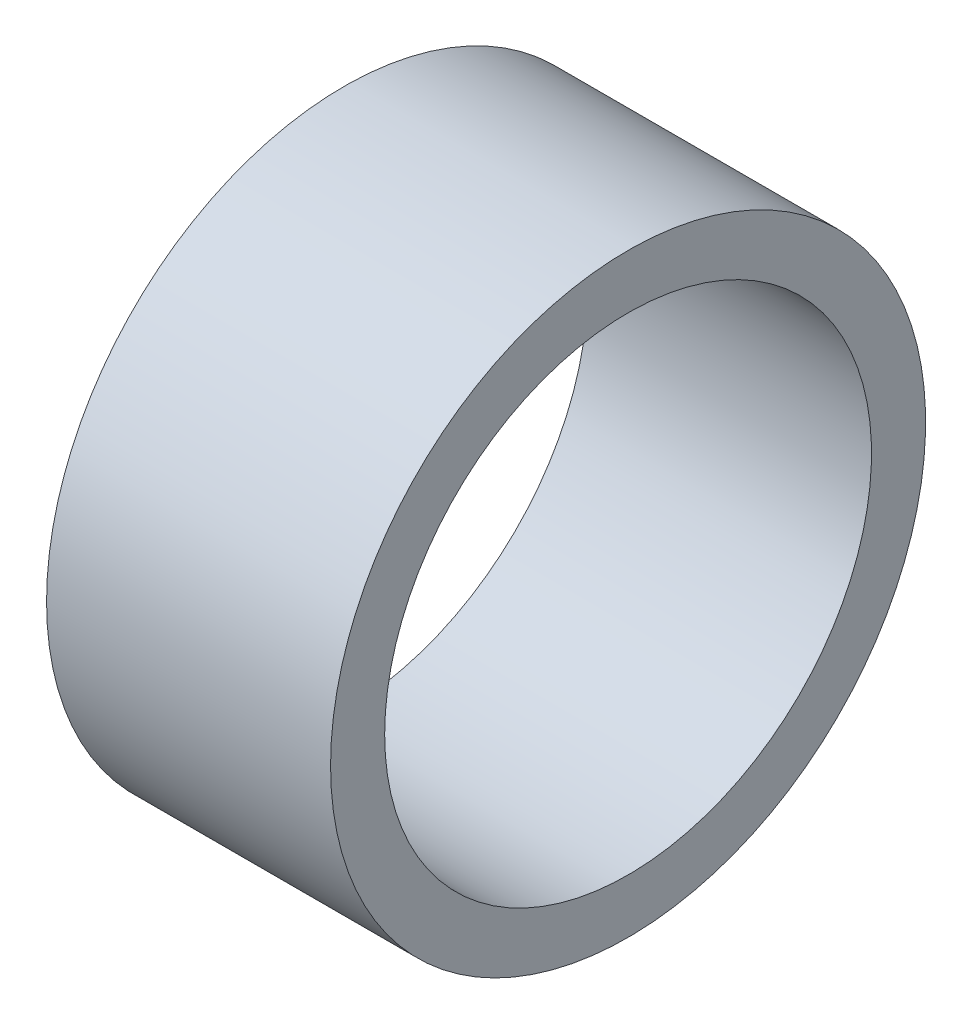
from build123d import *

# Parameters (mm, degrees)
ESQUISSE1_W = 21
ESQUISSE1_H = 4


with BuildPart() as part:
    # Esquisse1 → R_volution1 (revolve)
    with BuildSketch(Plane(origin=(0, 0, 0), x_dir=(-1, 0, 0), z_dir=(0, 0, -1)), mode=Mode.PRIVATE) as r_volution1_sk:
        with Locations((-10.5, 20)):
            Rectangle(ESQUISSE1_W, ESQUISSE1_H)
    revolve(r_volution1_sk.sketch.rotate(Axis((21, 0, 0), (-1, 0, 0)), 270), axis=Axis((21, 0, 0), (-1, 0, 0)))


solid = part.part
